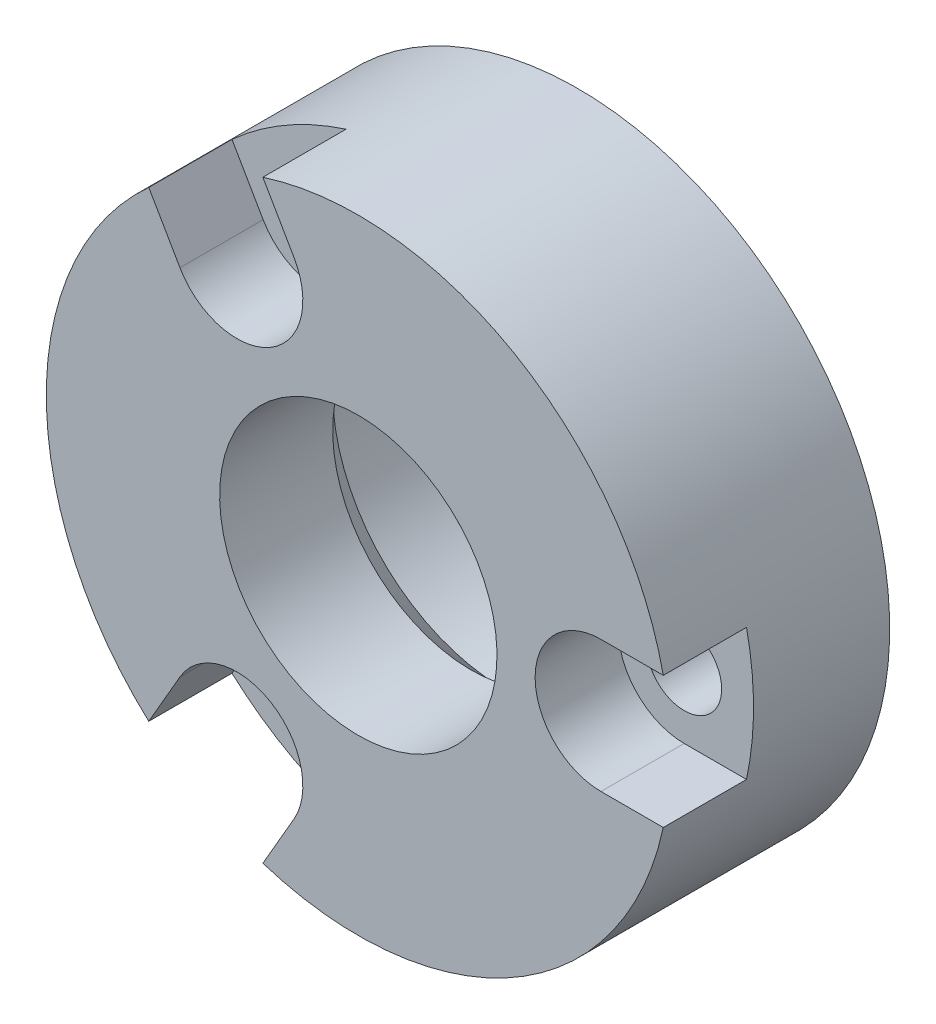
ISO-10303-21;
HEADER;
FILE_DESCRIPTION(('STEP AP214'),'2;1');
FILE_NAME('part.step','',(''),(''),'','','');
FILE_SCHEMA(('AUTOMOTIVE_DESIGN { 1 0 10303 214 1 1 1 1 }'));
ENDSEC;
DATA;
#1=APPLICATION_CONTEXT('core data for automotive mechanical design processes');
#2=APPLICATION_PROTOCOL_DEFINITION('international standard','automotive_design',2000,#1);
#3=PRODUCT_CONTEXT('',#1,'mechanical');
#4=PRODUCT('Part','Part','',(#3));
#5=PRODUCT_RELATED_PRODUCT_CATEGORY('part','',(#4));
#6=PRODUCT_DEFINITION_FORMATION('','',#4);
#7=PRODUCT_DEFINITION_CONTEXT('part definition',#1,'design');
#8=PRODUCT_DEFINITION('design','',#6,#7);
#9=PRODUCT_DEFINITION_SHAPE('','',#8);
#10=(LENGTH_UNIT() NAMED_UNIT(*) SI_UNIT(.MILLI.,.METRE.));
#11=(NAMED_UNIT(*) PLANE_ANGLE_UNIT() SI_UNIT($,.RADIAN.));
#12=(NAMED_UNIT(*) SI_UNIT($,.STERADIAN.) SOLID_ANGLE_UNIT());
#13=UNCERTAINTY_MEASURE_WITH_UNIT(LENGTH_MEASURE(1.E-05),#10,'distance_accuracy_value','');
#14=(GEOMETRIC_REPRESENTATION_CONTEXT(3) GLOBAL_UNCERTAINTY_ASSIGNED_CONTEXT((#13)) GLOBAL_UNIT_ASSIGNED_CONTEXT((#10,
#11,#12)) REPRESENTATION_CONTEXT('',''));
#15=CARTESIAN_POINT('',(0.,0.,0.));
#16=DIRECTION('',(0.,0.,1.));
#17=DIRECTION('',(1.,0.,0.));
#18=AXIS2_PLACEMENT_3D('',#15,#16,#17);
#19=CARTESIAN_POINT('',(0.,0.,40.));
#20=DIRECTION('',(0.,0.,1.));
#21=DIRECTION('',(0.499999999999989,0.866025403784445,0.));
#22=AXIS2_PLACEMENT_3D('',#19,#20,#21);
#23=CYLINDRICAL_SURFACE('',#22,22.5);
#24=CARTESIAN_POINT('',(0.,0.,0.));
#25=DIRECTION('',(0.,0.,1.));
#26=DIRECTION('',(0.499999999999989,0.866025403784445,0.));
#27=AXIS2_PLACEMENT_3D('',#24,#25,#26);
#28=CIRCLE('',#27,22.5);
#29=CARTESIAN_POINT('',(11.2499999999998,19.48557158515,0.));
#30=VERTEX_POINT('',#29);
#31=EDGE_CURVE('E9',#30,#30,#28,.T.);
#32=ORIENTED_EDGE('',*,*,#31,.T.);
#33=EDGE_LOOP('',(#32));
#34=FACE_BOUND('',#33,.T.);
#35=DIRECTION('',(0.,0.,1.));
#36=VECTOR('',#35,1.);
#37=CARTESIAN_POINT('',(21.9928965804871,4.75000000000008,9.82));
#38=LINE('',#37,#36);
#39=CARTESIAN_POINT('',(21.9928965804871,4.75000000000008,9.82));
#40=VERTEX_POINT('',#39);
#41=CARTESIAN_POINT('',(21.9928965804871,4.75000000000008,15.82));
#42=VERTEX_POINT('',#41);
#43=EDGE_CURVE('E103',#40,#42,#38,.T.);
#44=ORIENTED_EDGE('',*,*,#43,.F.);
#45=CARTESIAN_POINT('',(0.,0.,9.82));
#46=DIRECTION('',(0.,0.,1.));
#47=DIRECTION('',(-1.,0.,0.));
#48=AXIS2_PLACEMENT_3D('',#45,#46,#47);
#49=CIRCLE('',#48,22.5);
#50=CARTESIAN_POINT('',(21.9928965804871,-4.74999999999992,9.82));
#51=VERTEX_POINT('',#50);
#52=EDGE_CURVE('E321',#51,#40,#49,.T.);
#53=ORIENTED_EDGE('',*,*,#52,.F.);
#54=DIRECTION('',(0.,0.,1.));
#55=VECTOR('',#54,1.);
#56=CARTESIAN_POINT('',(21.9928965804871,-4.74999999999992,9.82));
#57=LINE('',#56,#55);
#58=CARTESIAN_POINT('',(21.9928965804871,-4.74999999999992,15.82));
#59=VERTEX_POINT('',#58);
#60=EDGE_CURVE('E112',#51,#59,#57,.T.);
#61=ORIENTED_EDGE('',*,*,#60,.T.);
#62=CARTESIAN_POINT('',(0.,0.,15.82));
#63=DIRECTION('',(0.,0.,1.));
#64=DIRECTION('',(0.499999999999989,0.866025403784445,0.));
#65=AXIS2_PLACEMENT_3D('',#62,#63,#64);
#66=CIRCLE('',#65,22.5);
#67=CARTESIAN_POINT('',(-6.88282762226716,-21.4214071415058,15.82));
#68=VERTEX_POINT('',#67);
#69=EDGE_CURVE('E23',#68,#59,#66,.T.);
#70=ORIENTED_EDGE('',*,*,#69,.F.);
#71=DIRECTION('',(0.,0.,1.));
#72=VECTOR('',#71,1.);
#73=CARTESIAN_POINT('',(-6.88282762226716,-21.4214071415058,9.82));
#74=LINE('',#73,#72);
#75=CARTESIAN_POINT('',(-6.88282762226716,-21.4214071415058,9.82));
#76=VERTEX_POINT('',#75);
#77=EDGE_CURVE('E177',#76,#68,#74,.T.);
#78=ORIENTED_EDGE('',*,*,#77,.F.);
#79=CARTESIAN_POINT('',(0.,0.,9.82));
#80=DIRECTION('',(0.,0.,1.));
#81=DIRECTION('',(0.499999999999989,0.866025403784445,0.));
#82=AXIS2_PLACEMENT_3D('',#79,#80,#81);
#83=CIRCLE('',#82,22.5);
#84=CARTESIAN_POINT('',(-15.1100689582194,-16.6714071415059,9.82));
#85=VERTEX_POINT('',#84);
#86=EDGE_CURVE('E165',#85,#76,#83,.T.);
#87=ORIENTED_EDGE('',*,*,#86,.F.);
#88=DIRECTION('',(0.,0.,1.));
#89=VECTOR('',#88,1.);
#90=CARTESIAN_POINT('',(-15.1100689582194,-16.6714071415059,9.82));
#91=LINE('',#90,#89);
#92=CARTESIAN_POINT('',(-15.1100689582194,-16.6714071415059,15.82));
#93=VERTEX_POINT('',#92);
#94=EDGE_CURVE('E174',#85,#93,#91,.T.);
#95=ORIENTED_EDGE('',*,*,#94,.T.);
#96=CARTESIAN_POINT('',(-15.1100689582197,16.6714071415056,15.82));
#97=VERTEX_POINT('',#96);
#98=EDGE_CURVE('E127',#97,#93,#66,.T.);
#99=ORIENTED_EDGE('',*,*,#98,.F.);
#100=DIRECTION('',(0.,0.,1.));
#101=VECTOR('',#100,1.);
#102=CARTESIAN_POINT('',(-15.1100689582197,16.6714071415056,9.82));
#103=LINE('',#102,#101);
#104=CARTESIAN_POINT('',(-15.1100689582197,16.6714071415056,9.82));
#105=VERTEX_POINT('',#104);
#106=EDGE_CURVE('E147',#105,#97,#103,.T.);
#107=ORIENTED_EDGE('',*,*,#106,.F.);
#108=CARTESIAN_POINT('',(0.,0.,9.82));
#109=DIRECTION('',(0.,0.,1.));
#110=DIRECTION('',(0.500000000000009,-0.866025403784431,0.));
#111=AXIS2_PLACEMENT_3D('',#108,#109,#110);
#112=CIRCLE('',#111,22.5);
#113=CARTESIAN_POINT('',(-6.88282762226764,21.4214071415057,9.82));
#114=VERTEX_POINT('',#113);
#115=EDGE_CURVE('E299',#114,#105,#112,.T.);
#116=ORIENTED_EDGE('',*,*,#115,.F.);
#117=DIRECTION('',(0.,0.,1.));
#118=VECTOR('',#117,1.);
#119=CARTESIAN_POINT('',(-6.88282762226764,21.4214071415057,9.82));
#120=LINE('',#119,#118);
#121=CARTESIAN_POINT('',(-6.88282762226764,21.4214071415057,15.82));
#122=VERTEX_POINT('',#121);
#123=EDGE_CURVE('E126',#114,#122,#120,.T.);
#124=ORIENTED_EDGE('',*,*,#123,.T.);
#125=EDGE_CURVE('E118',#42,#122,#66,.T.);
#126=ORIENTED_EDGE('',*,*,#125,.F.);
#127=EDGE_LOOP('',(#44,#53,#61,#70,#78,#87,#95,#99,#107,#116,#124,#126));
#128=FACE_BOUND('',#127,.T.);
#129=ADVANCED_FACE('F14',(#34,#128),#23,.T.);
#130=CARTESIAN_POINT('',(-19.48557158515,11.2499999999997,15.82));
#131=DIRECTION('',(0.,0.,-1.));
#132=DIRECTION('',(-0.499999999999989,-0.866025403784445,0.));
#133=AXIS2_PLACEMENT_3D('',#130,#131,#132);
#134=PLANE('',#133);
#135=CARTESIAN_POINT('',(0.,0.,15.82));
#136=DIRECTION('',(0.,0.,1.));
#137=DIRECTION('',(0.499999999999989,0.866025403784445,0.));
#138=AXIS2_PLACEMENT_3D('',#135,#136,#137);
#139=CIRCLE('',#138,10.);
#140=CARTESIAN_POINT('',(4.99999999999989,8.66025403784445,15.82));
#141=VERTEX_POINT('',#140);
#142=EDGE_CURVE('E130',#141,#141,#139,.T.);
#143=ORIENTED_EDGE('',*,*,#142,.F.);
#144=EDGE_LOOP('',(#143));
#145=FACE_BOUND('',#144,.T.);
#146=DIRECTION('',(1.,0.,0.));
#147=VECTOR('',#146,1.);
#148=CARTESIAN_POINT('',(17.5,4.75000000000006,15.82));
#149=LINE('',#148,#147);
#150=CARTESIAN_POINT('',(17.5,4.75000000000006,15.82));
#151=VERTEX_POINT('',#150);
#152=EDGE_CURVE('E31',#151,#42,#149,.T.);
#153=ORIENTED_EDGE('',*,*,#152,.T.);
#154=ORIENTED_EDGE('',*,*,#125,.T.);
#155=DIRECTION('',(-0.500000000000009,0.866025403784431,0.));
#156=VECTOR('',#155,1.);
#157=CARTESIAN_POINT('',(-4.63637933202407,17.5304445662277,15.82));
#158=LINE('',#157,#156);
#159=CARTESIAN_POINT('',(-4.63637933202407,17.5304445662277,15.82));
#160=VERTEX_POINT('',#159);
#161=EDGE_CURVE('E293',#160,#122,#158,.T.);
#162=ORIENTED_EDGE('',*,*,#161,.F.);
#163=CARTESIAN_POINT('',(-8.75000000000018,15.1554445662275,15.82));
#164=DIRECTION('',(0.,0.,-1.));
#165=DIRECTION('',(-0.500000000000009,0.866025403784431,0.));
#166=AXIS2_PLACEMENT_3D('',#163,#164,#165);
#167=CIRCLE('',#166,4.75);
#168=CARTESIAN_POINT('',(-12.8636206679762,12.7804445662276,15.82));
#169=VERTEX_POINT('',#168);
#170=EDGE_CURVE('E287',#160,#169,#167,.T.);
#171=ORIENTED_EDGE('',*,*,#170,.T.);
#172=DIRECTION('',(-0.500000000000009,0.866025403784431,0.));
#173=VECTOR('',#172,1.);
#174=CARTESIAN_POINT('',(-12.8636206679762,12.7804445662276,15.82));
#175=LINE('',#174,#173);
#176=EDGE_CURVE('E39',#169,#97,#175,.T.);
#177=ORIENTED_EDGE('',*,*,#176,.T.);
#178=ORIENTED_EDGE('',*,*,#98,.T.);
#179=DIRECTION('',(-0.499999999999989,-0.866025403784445,0.));
#180=VECTOR('',#179,1.);
#181=CARTESIAN_POINT('',(-12.8636206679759,-12.7804445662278,15.82));
#182=LINE('',#181,#180);
#183=CARTESIAN_POINT('',(-12.8636206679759,-12.7804445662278,15.82));
#184=VERTEX_POINT('',#183);
#185=EDGE_CURVE('E157',#184,#93,#182,.T.);
#186=ORIENTED_EDGE('',*,*,#185,.F.);
#187=CARTESIAN_POINT('',(-8.7499999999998,-15.1554445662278,15.82));
#188=DIRECTION('',(0.,0.,-1.));
#189=DIRECTION('',(-0.499999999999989,-0.866025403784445,0.));
#190=AXIS2_PLACEMENT_3D('',#187,#188,#189);
#191=CIRCLE('',#190,4.75);
#192=CARTESIAN_POINT('',(-4.63637933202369,-17.5304445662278,15.82));
#193=VERTEX_POINT('',#192);
#194=EDGE_CURVE('E140',#184,#193,#191,.T.);
#195=ORIENTED_EDGE('',*,*,#194,.T.);
#196=DIRECTION('',(-0.499999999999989,-0.866025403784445,0.));
#197=VECTOR('',#196,1.);
#198=CARTESIAN_POINT('',(-4.63637933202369,-17.5304445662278,15.82));
#199=LINE('',#198,#197);
#200=EDGE_CURVE('E145',#193,#68,#199,.T.);
#201=ORIENTED_EDGE('',*,*,#200,.T.);
#202=ORIENTED_EDGE('',*,*,#69,.T.);
#203=DIRECTION('',(1.,0.,0.));
#204=VECTOR('',#203,1.);
#205=CARTESIAN_POINT('',(17.5,-4.74999999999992,15.82));
#206=LINE('',#205,#204);
#207=CARTESIAN_POINT('',(17.5,-4.74999999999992,15.82));
#208=VERTEX_POINT('',#207);
#209=EDGE_CURVE('E122',#208,#59,#206,.T.);
#210=ORIENTED_EDGE('',*,*,#209,.F.);
#211=CARTESIAN_POINT('',(17.5,0.,15.82));
#212=DIRECTION('',(0.,0.,-1.));
#213=DIRECTION('',(1.,0.,0.));
#214=AXIS2_PLACEMENT_3D('',#211,#212,#213);
#215=CIRCLE('',#214,4.75);
#216=EDGE_CURVE('E121',#208,#151,#215,.T.);
#217=ORIENTED_EDGE('',*,*,#216,.T.);
#218=EDGE_LOOP('',(#153,#154,#162,#171,#177,#178,#186,#195,#201,#202,#210,#217));
#219=FACE_BOUND('',#218,.T.);
#220=ADVANCED_FACE('F116',(#145,#219),#134,.F.);
#221=CARTESIAN_POINT('',(-10.7387150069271,6.19999999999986,0.));
#222=DIRECTION('',(0.,0.,1.));
#223=DIRECTION('',(0.499999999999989,0.866025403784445,0.));
#224=AXIS2_PLACEMENT_3D('',#221,#222,#223);
#225=PLANE('',#224);
#226=CARTESIAN_POINT('',(17.5,0.,0.));
#227=DIRECTION('',(0.,0.,1.));
#228=DIRECTION('',(-1.,0.,0.));
#229=AXIS2_PLACEMENT_3D('',#226,#227,#228);
#230=CIRCLE('',#229,2.7);
#231=CARTESIAN_POINT('',(14.8,0.,0.));
#232=VERTEX_POINT('',#231);
#233=EDGE_CURVE('E136',#232,#232,#230,.T.);
#234=ORIENTED_EDGE('',*,*,#233,.T.);
#235=EDGE_LOOP('',(#234));
#236=FACE_BOUND('',#235,.T.);
#237=CARTESIAN_POINT('',(-8.75000000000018,15.1554445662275,0.));
#238=DIRECTION('',(0.,0.,1.));
#239=DIRECTION('',(0.500000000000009,-0.866025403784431,0.));
#240=AXIS2_PLACEMENT_3D('',#237,#238,#239);
#241=CIRCLE('',#240,2.7);
#242=CARTESIAN_POINT('',(-7.40000000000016,12.8171759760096,0.));
#243=VERTEX_POINT('',#242);
#244=EDGE_CURVE('E183',#243,#243,#241,.T.);
#245=ORIENTED_EDGE('',*,*,#244,.T.);
#246=EDGE_LOOP('',(#245));
#247=FACE_BOUND('',#246,.T.);
#248=CARTESIAN_POINT('',(-8.7499999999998,-15.1554445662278,0.));
#249=DIRECTION('',(0.,0.,1.));
#250=DIRECTION('',(0.499999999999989,0.866025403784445,0.));
#251=AXIS2_PLACEMENT_3D('',#248,#249,#250);
#252=CIRCLE('',#251,2.7);
#253=CARTESIAN_POINT('',(-7.39999999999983,-12.8171759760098,0.));
#254=VERTEX_POINT('',#253);
#255=EDGE_CURVE('E186',#254,#254,#252,.T.);
#256=ORIENTED_EDGE('',*,*,#255,.T.);
#257=EDGE_LOOP('',(#256));
#258=FACE_BOUND('',#257,.T.);
#259=ORIENTED_EDGE('',*,*,#31,.F.);
#260=EDGE_LOOP('',(#259));
#261=FACE_BOUND('',#260,.T.);
#262=CARTESIAN_POINT('',(0.,0.,0.));
#263=DIRECTION('',(0.,0.,1.));
#264=DIRECTION('',(0.499999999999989,0.866025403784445,0.));
#265=AXIS2_PLACEMENT_3D('',#262,#263,#264);
#266=CIRCLE('',#265,12.4);
#267=CARTESIAN_POINT('',(6.19999999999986,10.7387150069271,0.));
#268=VERTEX_POINT('',#267);
#269=EDGE_CURVE('E189',#268,#268,#266,.T.);
#270=ORIENTED_EDGE('',*,*,#269,.T.);
#271=EDGE_LOOP('',(#270));
#272=FACE_BOUND('',#271,.T.);
#273=ADVANCED_FACE('F16',(#236,#247,#258,#261,#272),#225,.F.);
#274=CARTESIAN_POINT('',(0.,0.,40.));
#275=DIRECTION('',(0.,0.,1.));
#276=DIRECTION('',(0.499999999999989,0.866025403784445,0.));
#277=AXIS2_PLACEMENT_3D('',#274,#275,#276);
#278=CYLINDRICAL_SURFACE('',#277,10.);
#279=CARTESIAN_POINT('',(0.,0.,7.67));
#280=DIRECTION('',(0.,0.,1.));
#281=DIRECTION('',(0.499999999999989,0.866025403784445,0.));
#282=AXIS2_PLACEMENT_3D('',#279,#280,#281);
#283=CIRCLE('',#282,10.);
#284=CARTESIAN_POINT('',(4.99999999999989,8.66025403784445,7.67));
#285=VERTEX_POINT('',#284);
#286=EDGE_CURVE('E194',#285,#285,#283,.T.);
#287=ORIENTED_EDGE('',*,*,#286,.F.);
#288=EDGE_LOOP('',(#287));
#289=FACE_BOUND('',#288,.T.);
#290=ORIENTED_EDGE('',*,*,#142,.T.);
#291=EDGE_LOOP('',(#290));
#292=FACE_BOUND('',#291,.T.);
#293=ADVANCED_FACE('F201',(#289,#292),#278,.F.);
#294=CARTESIAN_POINT('',(0.,0.,7.67));
#295=DIRECTION('',(0.,0.,-1.));
#296=DIRECTION('',(-0.499999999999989,-0.866025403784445,0.));
#297=AXIS2_PLACEMENT_3D('',#294,#295,#296);
#298=CONICAL_SURFACE('',#297,10.,0.785398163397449);
#299=CARTESIAN_POINT('',(0.,0.,5.27));
#300=DIRECTION('',(0.,0.,1.));
#301=DIRECTION('',(0.499999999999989,0.866025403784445,0.));
#302=AXIS2_PLACEMENT_3D('',#299,#300,#301);
#303=CIRCLE('',#302,12.4);
#304=CARTESIAN_POINT('',(6.19999999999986,10.7387150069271,5.27));
#305=VERTEX_POINT('',#304);
#306=EDGE_CURVE('E192',#305,#305,#303,.T.);
#307=ORIENTED_EDGE('',*,*,#306,.F.);
#308=EDGE_LOOP('',(#307));
#309=FACE_BOUND('',#308,.T.);
#310=ORIENTED_EDGE('',*,*,#286,.T.);
#311=EDGE_LOOP('',(#310));
#312=FACE_BOUND('',#311,.T.);
#313=ADVANCED_FACE('F215',(#309,#312),#298,.F.);
#314=CARTESIAN_POINT('',(0.,0.,40.));
#315=DIRECTION('',(0.,0.,1.));
#316=DIRECTION('',(0.499999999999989,0.866025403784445,0.));
#317=AXIS2_PLACEMENT_3D('',#314,#315,#316);
#318=CYLINDRICAL_SURFACE('',#317,12.4);
#319=ORIENTED_EDGE('',*,*,#269,.F.);
#320=EDGE_LOOP('',(#319));
#321=FACE_BOUND('',#320,.T.);
#322=ORIENTED_EDGE('',*,*,#306,.T.);
#323=EDGE_LOOP('',(#322));
#324=FACE_BOUND('',#323,.T.);
#325=ADVANCED_FACE('F219',(#321,#324),#318,.F.);
#326=CARTESIAN_POINT('',(-8.7499999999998,-15.1554445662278,0.));
#327=DIRECTION('',(0.,0.,1.));
#328=DIRECTION('',(0.499999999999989,0.866025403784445,0.));
#329=AXIS2_PLACEMENT_3D('',#326,#327,#328);
#330=CYLINDRICAL_SURFACE('',#329,2.7);
#331=CARTESIAN_POINT('',(-8.7499999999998,-15.1554445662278,9.82));
#332=DIRECTION('',(0.,0.,-1.));
#333=DIRECTION('',(-0.499999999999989,-0.866025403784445,0.));
#334=AXIS2_PLACEMENT_3D('',#331,#332,#333);
#335=CIRCLE('',#334,2.7);
#336=CARTESIAN_POINT('',(-10.0999999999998,-17.4937131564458,9.82));
#337=VERTEX_POINT('',#336);
#338=EDGE_CURVE('E134',#337,#337,#335,.F.);
#339=ORIENTED_EDGE('',*,*,#338,.T.);
#340=EDGE_LOOP('',(#339));
#341=FACE_BOUND('',#340,.T.);
#342=ORIENTED_EDGE('',*,*,#255,.F.);
#343=EDGE_LOOP('',(#342));
#344=FACE_BOUND('',#343,.T.);
#345=ADVANCED_FACE('F223',(#341,#344),#330,.F.);
#346=CARTESIAN_POINT('',(-8.75000000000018,15.1554445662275,0.));
#347=DIRECTION('',(0.,0.,1.));
#348=DIRECTION('',(0.499999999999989,0.866025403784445,0.));
#349=AXIS2_PLACEMENT_3D('',#346,#347,#348);
#350=CYLINDRICAL_SURFACE('',#349,2.7);
#351=CARTESIAN_POINT('',(-8.75000000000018,15.1554445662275,9.82));
#352=DIRECTION('',(0.,0.,-1.));
#353=DIRECTION('',(-0.499999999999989,-0.866025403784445,0.));
#354=AXIS2_PLACEMENT_3D('',#351,#352,#353);
#355=CIRCLE('',#354,2.7);
#356=CARTESIAN_POINT('',(-10.1000000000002,12.8171759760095,9.82));
#357=VERTEX_POINT('',#356);
#358=EDGE_CURVE('E138',#357,#357,#355,.F.);
#359=ORIENTED_EDGE('',*,*,#358,.T.);
#360=EDGE_LOOP('',(#359));
#361=FACE_BOUND('',#360,.T.);
#362=ORIENTED_EDGE('',*,*,#244,.F.);
#363=EDGE_LOOP('',(#362));
#364=FACE_BOUND('',#363,.T.);
#365=ADVANCED_FACE('F227',(#361,#364),#350,.F.);
#366=CARTESIAN_POINT('',(17.5,0.,0.));
#367=DIRECTION('',(0.,0.,1.));
#368=DIRECTION('',(0.499999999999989,0.866025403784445,0.));
#369=AXIS2_PLACEMENT_3D('',#366,#367,#368);
#370=CYLINDRICAL_SURFACE('',#369,2.7);
#371=CARTESIAN_POINT('',(17.5,0.,9.82));
#372=DIRECTION('',(0.,0.,-1.));
#373=DIRECTION('',(-0.499999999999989,-0.866025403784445,0.));
#374=AXIS2_PLACEMENT_3D('',#371,#372,#373);
#375=CIRCLE('',#374,2.7);
#376=CARTESIAN_POINT('',(16.15,-2.33826859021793,9.82));
#377=VERTEX_POINT('',#376);
#378=EDGE_CURVE('E18',#377,#377,#375,.F.);
#379=ORIENTED_EDGE('',*,*,#378,.T.);
#380=EDGE_LOOP('',(#379));
#381=FACE_BOUND('',#380,.T.);
#382=ORIENTED_EDGE('',*,*,#233,.F.);
#383=EDGE_LOOP('',(#382));
#384=FACE_BOUND('',#383,.T.);
#385=ADVANCED_FACE('F231',(#381,#384),#370,.F.);
#386=CARTESIAN_POINT('',(-8.7499999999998,-15.1554445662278,9.82));
#387=DIRECTION('',(0.,0.,-1.));
#388=DIRECTION('',(-0.499999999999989,-0.866025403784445,0.));
#389=AXIS2_PLACEMENT_3D('',#386,#387,#388);
#390=PLANE('',#389);
#391=CARTESIAN_POINT('',(-8.7499999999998,-15.1554445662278,9.82));
#392=DIRECTION('',(0.,0.,-1.));
#393=DIRECTION('',(-0.499999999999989,-0.866025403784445,0.));
#394=AXIS2_PLACEMENT_3D('',#391,#392,#393);
#395=CIRCLE('',#394,4.75);
#396=CARTESIAN_POINT('',(-12.8636206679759,-12.7804445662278,9.82));
#397=VERTEX_POINT('',#396);
#398=CARTESIAN_POINT('',(-4.63637933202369,-17.5304445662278,9.82));
#399=VERTEX_POINT('',#398);
#400=EDGE_CURVE('E160',#397,#399,#395,.T.);
#401=ORIENTED_EDGE('',*,*,#400,.F.);
#402=DIRECTION('',(-0.499999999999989,-0.866025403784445,0.));
#403=VECTOR('',#402,1.);
#404=CARTESIAN_POINT('',(-12.8636206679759,-12.7804445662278,9.82));
#405=LINE('',#404,#403);
#406=EDGE_CURVE('E168',#397,#85,#405,.T.);
#407=ORIENTED_EDGE('',*,*,#406,.T.);
#408=ORIENTED_EDGE('',*,*,#86,.T.);
#409=DIRECTION('',(-0.499999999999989,-0.866025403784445,0.));
#410=VECTOR('',#409,1.);
#411=CARTESIAN_POINT('',(-4.63637933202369,-17.5304445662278,9.82));
#412=LINE('',#411,#410);
#413=EDGE_CURVE('E163',#399,#76,#412,.T.);
#414=ORIENTED_EDGE('',*,*,#413,.F.);
#415=EDGE_LOOP('',(#401,#407,#408,#414));
#416=FACE_BOUND('',#415,.T.);
#417=ORIENTED_EDGE('',*,*,#338,.F.);
#418=EDGE_LOOP('',(#417));
#419=FACE_BOUND('',#418,.T.);
#420=ADVANCED_FACE('F234',(#416,#419),#390,.F.);
#421=CARTESIAN_POINT('',(-4.63637933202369,-17.5304445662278,9.82));
#422=DIRECTION('',(-0.866025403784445,0.499999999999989,0.));
#423=DIRECTION('',(-0.499999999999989,-0.866025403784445,0.));
#424=AXIS2_PLACEMENT_3D('',#421,#422,#423);
#425=PLANE('',#424);
#426=ORIENTED_EDGE('',*,*,#77,.T.);
#427=ORIENTED_EDGE('',*,*,#200,.F.);
#428=DIRECTION('',(0.,0.,1.));
#429=VECTOR('',#428,1.);
#430=CARTESIAN_POINT('',(-4.63637933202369,-17.5304445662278,9.82));
#431=LINE('',#430,#429);
#432=EDGE_CURVE('E137',#399,#193,#431,.T.);
#433=ORIENTED_EDGE('',*,*,#432,.F.);
#434=ORIENTED_EDGE('',*,*,#413,.T.);
#435=EDGE_LOOP('',(#426,#427,#433,#434));
#436=FACE_BOUND('',#435,.T.);
#437=ADVANCED_FACE('F236',(#436),#425,.T.);
#438=CARTESIAN_POINT('',(-12.8636206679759,-12.7804445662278,9.82));
#439=DIRECTION('',(-0.866025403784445,0.499999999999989,0.));
#440=DIRECTION('',(-0.499999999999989,-0.866025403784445,0.));
#441=AXIS2_PLACEMENT_3D('',#438,#439,#440);
#442=PLANE('',#441);
#443=DIRECTION('',(0.,0.,1.));
#444=VECTOR('',#443,1.);
#445=CARTESIAN_POINT('',(-12.8636206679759,-12.7804445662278,9.82));
#446=LINE('',#445,#444);
#447=EDGE_CURVE('E171',#397,#184,#446,.T.);
#448=ORIENTED_EDGE('',*,*,#447,.T.);
#449=ORIENTED_EDGE('',*,*,#185,.T.);
#450=ORIENTED_EDGE('',*,*,#94,.F.);
#451=ORIENTED_EDGE('',*,*,#406,.F.);
#452=EDGE_LOOP('',(#448,#449,#450,#451));
#453=FACE_BOUND('',#452,.T.);
#454=ADVANCED_FACE('F239',(#453),#442,.F.);
#455=CARTESIAN_POINT('',(-8.7499999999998,-15.1554445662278,9.82));
#456=DIRECTION('',(0.,0.,1.));
#457=DIRECTION('',(0.499999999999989,0.866025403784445,0.));
#458=AXIS2_PLACEMENT_3D('',#455,#456,#457);
#459=CYLINDRICAL_SURFACE('',#458,4.75);
#460=ORIENTED_EDGE('',*,*,#400,.T.);
#461=ORIENTED_EDGE('',*,*,#432,.T.);
#462=ORIENTED_EDGE('',*,*,#194,.F.);
#463=ORIENTED_EDGE('',*,*,#447,.F.);
#464=EDGE_LOOP('',(#460,#461,#462,#463));
#465=FACE_BOUND('',#464,.T.);
#466=ADVANCED_FACE('F243',(#465),#459,.F.);
#467=CARTESIAN_POINT('',(-8.75000000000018,15.1554445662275,9.82));
#468=DIRECTION('',(0.,0.,-1.));
#469=DIRECTION('',(-0.500000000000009,0.866025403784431,0.));
#470=AXIS2_PLACEMENT_3D('',#467,#468,#469);
#471=PLANE('',#470);
#472=CARTESIAN_POINT('',(-8.75000000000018,15.1554445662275,9.82));
#473=DIRECTION('',(0.,0.,-1.));
#474=DIRECTION('',(-0.500000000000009,0.866025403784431,0.));
#475=AXIS2_PLACEMENT_3D('',#472,#473,#474);
#476=CIRCLE('',#475,4.75);
#477=CARTESIAN_POINT('',(-4.63637933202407,17.5304445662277,9.82));
#478=VERTEX_POINT('',#477);
#479=CARTESIAN_POINT('',(-12.8636206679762,12.7804445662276,9.82));
#480=VERTEX_POINT('',#479);
#481=EDGE_CURVE('E295',#478,#480,#476,.T.);
#482=ORIENTED_EDGE('',*,*,#481,.F.);
#483=DIRECTION('',(-0.500000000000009,0.866025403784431,0.));
#484=VECTOR('',#483,1.);
#485=CARTESIAN_POINT('',(-4.63637933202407,17.5304445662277,9.82));
#486=LINE('',#485,#484);
#487=EDGE_CURVE('E302',#478,#114,#486,.T.);
#488=ORIENTED_EDGE('',*,*,#487,.T.);
#489=ORIENTED_EDGE('',*,*,#115,.T.);
#490=DIRECTION('',(-0.500000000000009,0.866025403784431,0.));
#491=VECTOR('',#490,1.);
#492=CARTESIAN_POINT('',(-12.8636206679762,12.7804445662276,9.82));
#493=LINE('',#492,#491);
#494=EDGE_CURVE('E297',#480,#105,#493,.T.);
#495=ORIENTED_EDGE('',*,*,#494,.F.);
#496=EDGE_LOOP('',(#482,#488,#489,#495));
#497=FACE_BOUND('',#496,.T.);
#498=ORIENTED_EDGE('',*,*,#358,.F.);
#499=EDGE_LOOP('',(#498));
#500=FACE_BOUND('',#499,.T.);
#501=ADVANCED_FACE('F247',(#497,#500),#471,.F.);
#502=CARTESIAN_POINT('',(-12.8636206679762,12.7804445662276,9.82));
#503=DIRECTION('',(0.866025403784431,0.500000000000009,0.));
#504=DIRECTION('',(-0.500000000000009,0.866025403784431,0.));
#505=AXIS2_PLACEMENT_3D('',#502,#503,#504);
#506=PLANE('',#505);
#507=ORIENTED_EDGE('',*,*,#106,.T.);
#508=ORIENTED_EDGE('',*,*,#176,.F.);
#509=DIRECTION('',(0.,0.,1.));
#510=VECTOR('',#509,1.);
#511=CARTESIAN_POINT('',(-12.8636206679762,12.7804445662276,9.82));
#512=LINE('',#511,#510);
#513=EDGE_CURVE('E141',#480,#169,#512,.T.);
#514=ORIENTED_EDGE('',*,*,#513,.F.);
#515=ORIENTED_EDGE('',*,*,#494,.T.);
#516=EDGE_LOOP('',(#507,#508,#514,#515));
#517=FACE_BOUND('',#516,.T.);
#518=ADVANCED_FACE('F252',(#517),#506,.T.);
#519=CARTESIAN_POINT('',(-4.63637933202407,17.5304445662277,9.82));
#520=DIRECTION('',(0.866025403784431,0.500000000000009,0.));
#521=DIRECTION('',(-0.500000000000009,0.866025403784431,0.));
#522=AXIS2_PLACEMENT_3D('',#519,#520,#521);
#523=PLANE('',#522);
#524=DIRECTION('',(0.,0.,1.));
#525=VECTOR('',#524,1.);
#526=CARTESIAN_POINT('',(-4.63637933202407,17.5304445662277,9.82));
#527=LINE('',#526,#525);
#528=EDGE_CURVE('E305',#478,#160,#527,.T.);
#529=ORIENTED_EDGE('',*,*,#528,.T.);
#530=ORIENTED_EDGE('',*,*,#161,.T.);
#531=ORIENTED_EDGE('',*,*,#123,.F.);
#532=ORIENTED_EDGE('',*,*,#487,.F.);
#533=EDGE_LOOP('',(#529,#530,#531,#532));
#534=FACE_BOUND('',#533,.T.);
#535=ADVANCED_FACE('F255',(#534),#523,.F.);
#536=CARTESIAN_POINT('',(-8.75000000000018,15.1554445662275,9.82));
#537=DIRECTION('',(0.,0.,1.));
#538=DIRECTION('',(0.499999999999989,0.866025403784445,0.));
#539=AXIS2_PLACEMENT_3D('',#536,#537,#538);
#540=CYLINDRICAL_SURFACE('',#539,4.75);
#541=ORIENTED_EDGE('',*,*,#481,.T.);
#542=ORIENTED_EDGE('',*,*,#513,.T.);
#543=ORIENTED_EDGE('',*,*,#170,.F.);
#544=ORIENTED_EDGE('',*,*,#528,.F.);
#545=EDGE_LOOP('',(#541,#542,#543,#544));
#546=FACE_BOUND('',#545,.T.);
#547=ADVANCED_FACE('F258',(#546),#540,.F.);
#548=CARTESIAN_POINT('',(17.5,0.,9.82));
#549=DIRECTION('',(0.,0.,-1.));
#550=DIRECTION('',(1.,0.,0.));
#551=AXIS2_PLACEMENT_3D('',#548,#549,#550);
#552=PLANE('',#551);
#553=CARTESIAN_POINT('',(17.5,0.,9.82));
#554=DIRECTION('',(0.,0.,-1.));
#555=DIRECTION('',(1.,0.,0.));
#556=AXIS2_PLACEMENT_3D('',#553,#554,#555);
#557=CIRCLE('',#556,4.75);
#558=CARTESIAN_POINT('',(17.5,-4.74999999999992,9.82));
#559=VERTEX_POINT('',#558);
#560=CARTESIAN_POINT('',(17.5,4.75000000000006,9.82));
#561=VERTEX_POINT('',#560);
#562=EDGE_CURVE('E283',#559,#561,#557,.T.);
#563=ORIENTED_EDGE('',*,*,#562,.F.);
#564=DIRECTION('',(1.,0.,0.));
#565=VECTOR('',#564,1.);
#566=CARTESIAN_POINT('',(17.5,-4.74999999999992,9.82));
#567=LINE('',#566,#565);
#568=EDGE_CURVE('E325',#559,#51,#567,.T.);
#569=ORIENTED_EDGE('',*,*,#568,.T.);
#570=ORIENTED_EDGE('',*,*,#52,.T.);
#571=DIRECTION('',(1.,0.,0.));
#572=VECTOR('',#571,1.);
#573=CARTESIAN_POINT('',(17.5,4.75000000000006,9.82));
#574=LINE('',#573,#572);
#575=EDGE_CURVE('E106',#561,#40,#574,.T.);
#576=ORIENTED_EDGE('',*,*,#575,.F.);
#577=EDGE_LOOP('',(#563,#569,#570,#576));
#578=FACE_BOUND('',#577,.T.);
#579=ORIENTED_EDGE('',*,*,#378,.F.);
#580=EDGE_LOOP('',(#579));
#581=FACE_BOUND('',#580,.T.);
#582=ADVANCED_FACE('F262',(#578,#581),#552,.F.);
#583=CARTESIAN_POINT('',(17.5,4.75000000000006,9.82));
#584=DIRECTION('',(0.,-1.,0.));
#585=DIRECTION('',(1.,0.,0.));
#586=AXIS2_PLACEMENT_3D('',#583,#584,#585);
#587=PLANE('',#586);
#588=ORIENTED_EDGE('',*,*,#43,.T.);
#589=ORIENTED_EDGE('',*,*,#152,.F.);
#590=DIRECTION('',(0.,0.,1.));
#591=VECTOR('',#590,1.);
#592=CARTESIAN_POINT('',(17.5,4.75000000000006,9.82));
#593=LINE('',#592,#591);
#594=EDGE_CURVE('E111',#561,#151,#593,.T.);
#595=ORIENTED_EDGE('',*,*,#594,.F.);
#596=ORIENTED_EDGE('',*,*,#575,.T.);
#597=EDGE_LOOP('',(#588,#589,#595,#596));
#598=FACE_BOUND('',#597,.T.);
#599=ADVANCED_FACE('F104',(#598),#587,.T.);
#600=CARTESIAN_POINT('',(17.5,-4.74999999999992,9.82));
#601=DIRECTION('',(0.,-1.,0.));
#602=DIRECTION('',(1.,0.,0.));
#603=AXIS2_PLACEMENT_3D('',#600,#601,#602);
#604=PLANE('',#603);
#605=DIRECTION('',(0.,0.,1.));
#606=VECTOR('',#605,1.);
#607=CARTESIAN_POINT('',(17.5,-4.74999999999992,9.82));
#608=LINE('',#607,#606);
#609=EDGE_CURVE('E323',#559,#208,#608,.T.);
#610=ORIENTED_EDGE('',*,*,#609,.T.);
#611=ORIENTED_EDGE('',*,*,#209,.T.);
#612=ORIENTED_EDGE('',*,*,#60,.F.);
#613=ORIENTED_EDGE('',*,*,#568,.F.);
#614=EDGE_LOOP('',(#610,#611,#612,#613));
#615=FACE_BOUND('',#614,.T.);
#616=ADVANCED_FACE('F268',(#615),#604,.F.);
#617=CARTESIAN_POINT('',(17.5,0.,9.82));
#618=DIRECTION('',(0.,0.,1.));
#619=DIRECTION('',(0.499999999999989,0.866025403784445,0.));
#620=AXIS2_PLACEMENT_3D('',#617,#618,#619);
#621=CYLINDRICAL_SURFACE('',#620,4.75);
#622=ORIENTED_EDGE('',*,*,#562,.T.);
#623=ORIENTED_EDGE('',*,*,#594,.T.);
#624=ORIENTED_EDGE('',*,*,#216,.F.);
#625=ORIENTED_EDGE('',*,*,#609,.F.);
#626=EDGE_LOOP('',(#622,#623,#624,#625));
#627=FACE_BOUND('',#626,.T.);
#628=ADVANCED_FACE('F271',(#627),#621,.F.);
#629=CLOSED_SHELL('',(#129,#220,#273,#293,#313,#325,#345,#365,#385,#420,#437,#454,#466,#501,
#518,#535,#547,#582,#599,#616,#628));
#630=MANIFOLD_SOLID_BREP('B1',#629);
#631=ADVANCED_BREP_SHAPE_REPRESENTATION('',(#18,#630),#14);
#632=SHAPE_DEFINITION_REPRESENTATION(#9,#631);
ENDSEC;
END-ISO-10303-21;
